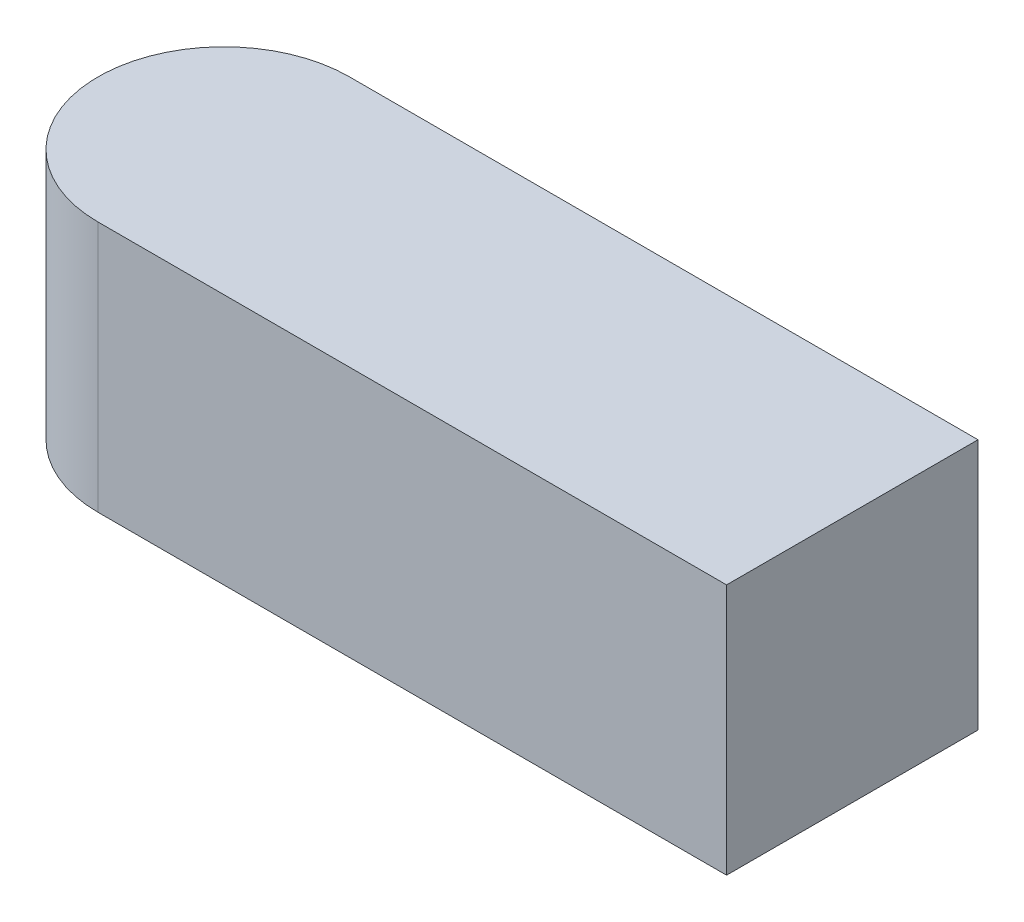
from build123d import *

# Parameters (mm, degrees)
BASE_EXTRUSION_DEPTH = 6


with BuildPart() as part:
    # Esquisse1 → Base-Extrusion (new body)
    with BuildSketch(Plane(origin=(0, 0, 0), x_dir=(1, 0, 0), z_dir=(0, 1, 0))):
        with BuildLine():
            Line((0, 3), (15, 3))
            Line((15, 3), (15, -3))
            Line((15, -3), (0, -3))
            ThreePointArc((0, -3), (-3, 0), (0, 3))
        make_face()
    extrude(amount=BASE_EXTRUSION_DEPTH)


solid = part.part
